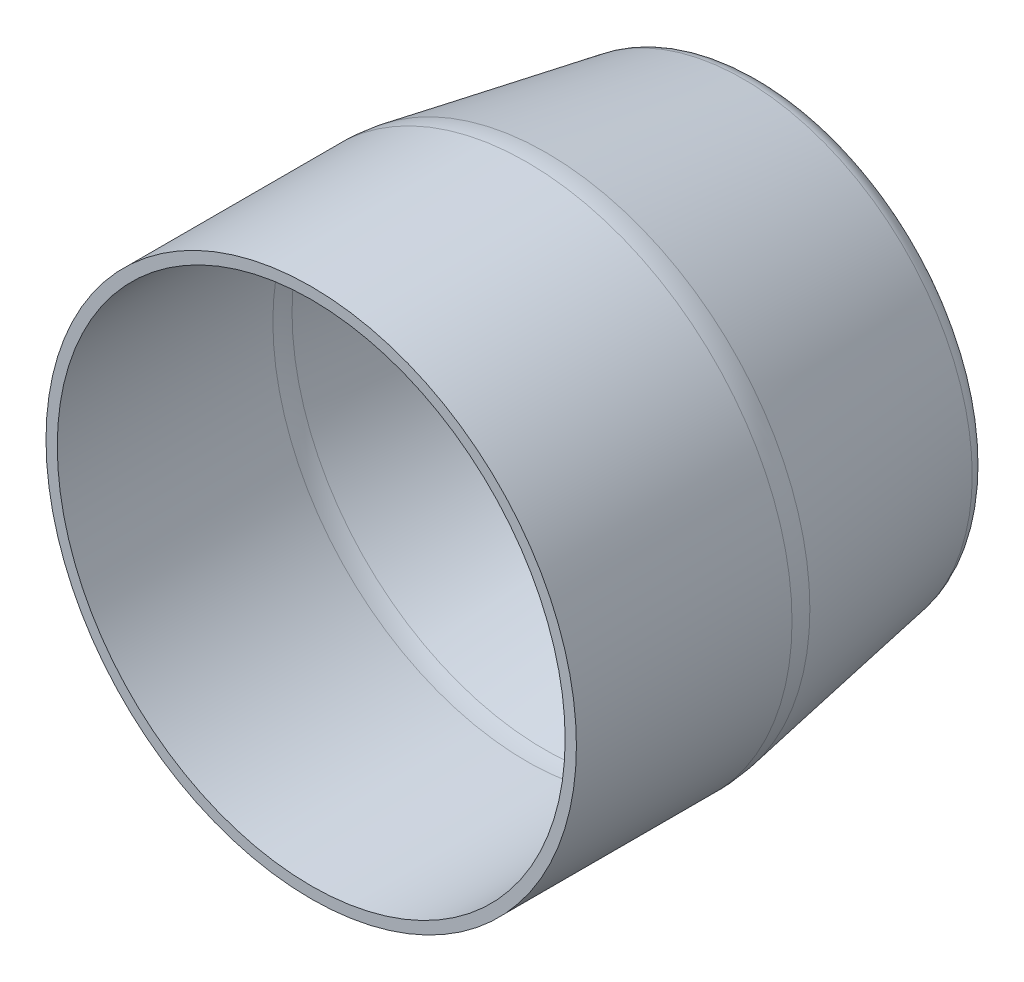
from build123d import *

# Parameters (mm, degrees)
SKETCH1_R      = 1000
EXTRUDE1_DEPTH = 1000
EXTRUDE1_DRAFT = -10
SKETCH3_R      = 1176.326980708
EXTRUDE2_DEPTH = 1000
FILLET1_R      = 100
FILLET2_R      = 500
SHELL1_T       = -50


with BuildPart() as part:
    # Sketch1 → Extrude1 (with draft: the straight prism first)
    with BuildSketch(Plane.XY):
        Circle(SKETCH1_R)
    extrude(amount=EXTRUDE1_DEPTH)
    # Extrude1: the draft: its side faces are tilted about the plane it starts from
    extrude1_sides = [part.faces().sort_by_distance(p)[0] for p in [
        (-1000, 0, 500),
    ]]
    draft(extrude1_sides, Plane.XY, EXTRUDE1_DRAFT)

    # Sketch3 → Extrude2 (add)
    with BuildSketch(Plane.XY.offset(1000)):
        Circle(SKETCH3_R)
    extrude(amount=EXTRUDE2_DEPTH)

    # Fillet1
    fillet1_edges = [part.edges().sort_by_distance(p)[0] for p in [
        (-1000, 0, 0),
    ]]
    fillet(fillet1_edges, radius=FILLET1_R)

    # Fillet2
    fillet2_edges = [part.edges().sort_by_distance(p)[0] for p in [
        (-1176.326980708, 0, 1000),
    ]]
    fillet(fillet2_edges, radius=FILLET2_R)

    # Shell1
    shell1_openings = [part.faces().sort_by_distance(p)[0] for p in [
        (0, 0, 2000),
    ]]
    offset(amount=SHELL1_T, openings=shell1_openings, kind=Kind.INTERSECTION)


solid = part.part
